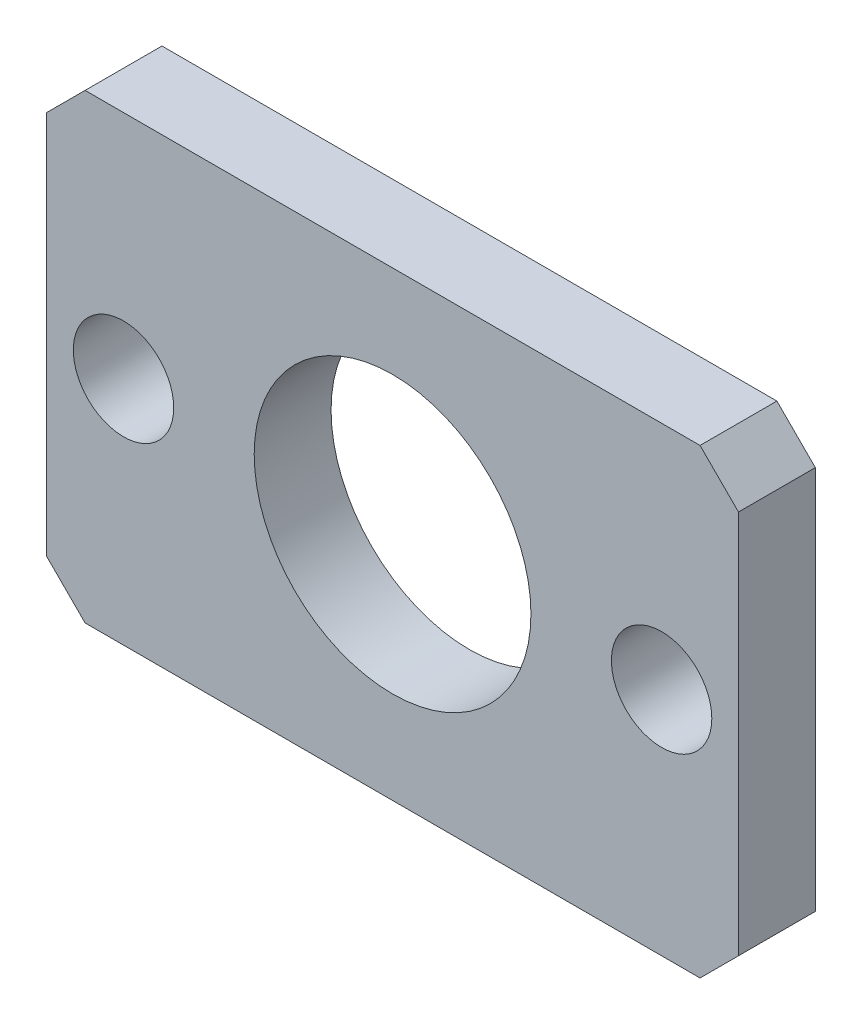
from build123d import *

# Parameters (mm, degrees)
ESQUISSE1_W             = 45
ESQUISSE1_H             = 30
EXTRUSION1_DEPTH        = 5
CHANFREIN1_SIZE         = 2.5
ESQUISSE2_R             = 9
ENL_V_MAT_EXTRU_1_DEPTH = 28.5
ESQUISSE3_R             = 3.265
ENL_V_MAT_EXTRU_2_DEPTH = 28.5


with BuildPart() as part:
    # Esquisse1 → Extrusion1 (new body)
    with BuildSketch(Plane.XY):
        Rectangle(ESQUISSE1_W, ESQUISSE1_H)
    extrude(amount=EXTRUSION1_DEPTH)

    # Chanfrein1
    chanfrein1_edges = [part.edges().sort_by_distance(p)[0] for p in [
        (-22.5, 15, 2.5),
        (22.5, 15, 2.5),
        (22.5, -15, 2.5),
        (-22.5, -15, 2.5),
    ]]
    chamfer(chanfrein1_edges, length=CHANFREIN1_SIZE)

    # Esquisse2 → Enl_v. mat.-Extru.1 (cut, through all)
    with BuildSketch(Plane.XY.offset(5)):
        Circle(ESQUISSE2_R)
    extrude(amount=-ENL_V_MAT_EXTRU_1_DEPTH, mode=Mode.SUBTRACT)

    # Esquisse3 → Enl_v. mat.-Extru.2 (cut, through all)
    with BuildSketch(Plane.XY.offset(5)):
        with Locations((17.5, 0)):
            Circle(ESQUISSE3_R)
        with Locations((-17.5, 0)):
            Circle(ESQUISSE3_R)
    extrude(amount=-ENL_V_MAT_EXTRU_2_DEPTH, mode=Mode.SUBTRACT)


solid = part.part
